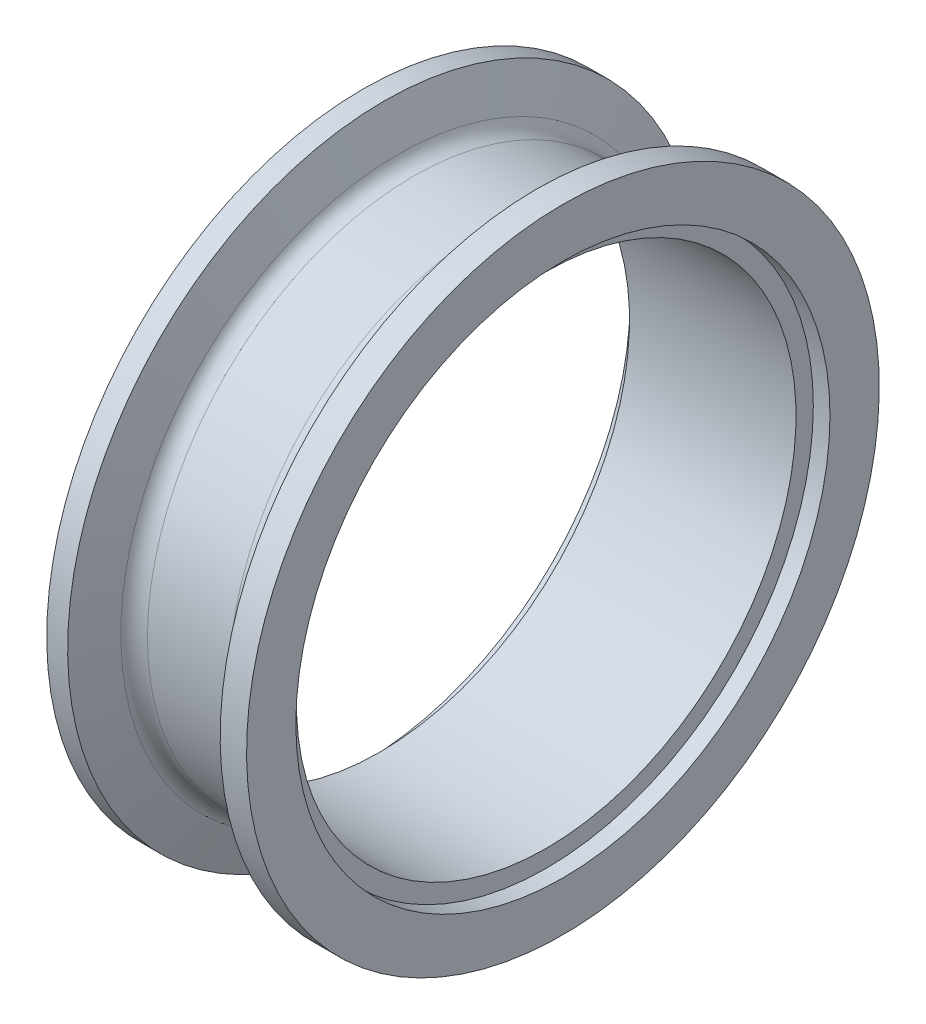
ISO-10303-21;
HEADER;
FILE_DESCRIPTION(('STEP AP214'),'2;1');
FILE_NAME('part.step','',(''),(''),'','','');
FILE_SCHEMA(('AUTOMOTIVE_DESIGN { 1 0 10303 214 1 1 1 1 }'));
ENDSEC;
DATA;
#1=APPLICATION_CONTEXT('core data for automotive mechanical design processes');
#2=APPLICATION_PROTOCOL_DEFINITION('international standard','automotive_design',2000,#1);
#3=PRODUCT_CONTEXT('',#1,'mechanical');
#4=PRODUCT('Part','Part','',(#3));
#5=PRODUCT_RELATED_PRODUCT_CATEGORY('part','',(#4));
#6=PRODUCT_DEFINITION_FORMATION('','',#4);
#7=PRODUCT_DEFINITION_CONTEXT('part definition',#1,'design');
#8=PRODUCT_DEFINITION('design','',#6,#7);
#9=PRODUCT_DEFINITION_SHAPE('','',#8);
#10=(LENGTH_UNIT() NAMED_UNIT(*) SI_UNIT(.MILLI.,.METRE.));
#11=(NAMED_UNIT(*) PLANE_ANGLE_UNIT() SI_UNIT($,.RADIAN.));
#12=(NAMED_UNIT(*) SI_UNIT($,.STERADIAN.) SOLID_ANGLE_UNIT());
#13=UNCERTAINTY_MEASURE_WITH_UNIT(LENGTH_MEASURE(1.E-05),#10,'distance_accuracy_value','');
#14=(GEOMETRIC_REPRESENTATION_CONTEXT(3) GLOBAL_UNCERTAINTY_ASSIGNED_CONTEXT((#13)) GLOBAL_UNIT_ASSIGNED_CONTEXT((#10,
#11,#12)) REPRESENTATION_CONTEXT('',''));
#15=CARTESIAN_POINT('',(0.,0.,0.));
#16=DIRECTION('',(0.,0.,1.));
#17=DIRECTION('',(1.,0.,0.));
#18=AXIS2_PLACEMENT_3D('',#15,#16,#17);
#19=CARTESIAN_POINT('',(0.,60.325,0.));
#20=DIRECTION('',(-1.,0.,0.));
#21=DIRECTION('',(0.,-1.,0.));
#22=AXIS2_PLACEMENT_3D('',#19,#20,#21);
#23=PLANE('',#22);
#24=CARTESIAN_POINT('',(0.,0.,0.));
#25=DIRECTION('',(1.,0.,0.));
#26=DIRECTION('',(0.,1.,0.));
#27=AXIS2_PLACEMENT_3D('',#24,#25,#26);
#28=CIRCLE('',#27,50.927);
#29=CARTESIAN_POINT('',(0.,50.927,0.));
#30=VERTEX_POINT('',#29);
#31=EDGE_CURVE('E95',#30,#30,#28,.T.);
#32=ORIENTED_EDGE('',*,*,#31,.T.);
#33=EDGE_LOOP('',(#32));
#34=FACE_BOUND('',#33,.T.);
#35=CARTESIAN_POINT('',(-1.11022302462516E-13,0.,0.));
#36=DIRECTION('',(1.,0.,0.));
#37=DIRECTION('',(0.,1.,0.));
#38=AXIS2_PLACEMENT_3D('',#35,#36,#37);
#39=CIRCLE('',#38,60.325);
#40=CARTESIAN_POINT('',(0.,60.325,0.));
#41=VERTEX_POINT('',#40);
#42=EDGE_CURVE('E12',#41,#41,#39,.T.);
#43=ORIENTED_EDGE('',*,*,#42,.F.);
#44=EDGE_LOOP('',(#43));
#45=FACE_BOUND('',#44,.T.);
#46=ADVANCED_FACE('F49',(#34,#45),#23,.T.);
#47=CARTESIAN_POINT('',(19.0500000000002,0.,0.));
#48=DIRECTION('',(1.,0.,0.));
#49=DIRECTION('',(0.,1.,0.));
#50=AXIS2_PLACEMENT_3D('',#47,#48,#49);
#51=CYLINDRICAL_SURFACE('',#50,60.325);
#52=ORIENTED_EDGE('',*,*,#42,.T.);
#53=EDGE_LOOP('',(#52));
#54=FACE_BOUND('',#53,.T.);
#55=CARTESIAN_POINT('',(3.98779999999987,0.,0.));
#56=DIRECTION('',(1.,0.,0.));
#57=DIRECTION('',(0.,1.,0.));
#58=AXIS2_PLACEMENT_3D('',#55,#56,#57);
#59=CIRCLE('',#58,60.325);
#60=CARTESIAN_POINT('',(3.98779999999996,60.325,0.));
#61=VERTEX_POINT('',#60);
#62=EDGE_CURVE('E55',#61,#61,#59,.T.);
#63=ORIENTED_EDGE('',*,*,#62,.F.);
#64=EDGE_LOOP('',(#63));
#65=FACE_BOUND('',#64,.T.);
#66=ADVANCED_FACE('F113',(#54,#65),#51,.T.);
#67=CARTESIAN_POINT('',(6.69425134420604,0.,0.));
#68=DIRECTION('',(-1.,0.,0.));
#69=DIRECTION('',(0.,-1.,0.));
#70=AXIS2_PLACEMENT_3D('',#67,#68,#69);
#71=CONICAL_SURFACE('',#70,52.889086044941,1.22173047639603);
#72=ORIENTED_EDGE('',*,*,#62,.T.);
#73=EDGE_LOOP('',(#72));
#74=FACE_BOUND('',#73,.T.);
#75=CARTESIAN_POINT('',(6.69425134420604,0.,0.));
#76=DIRECTION('',(1.,0.,0.));
#77=DIRECTION('',(0.,1.,0.));
#78=AXIS2_PLACEMENT_3D('',#75,#76,#77);
#79=CIRCLE('',#78,52.889086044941);
#80=CARTESIAN_POINT('',(6.69425134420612,52.889086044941,0.));
#81=VERTEX_POINT('',#80);
#82=EDGE_CURVE('E59',#81,#81,#79,.T.);
#83=ORIENTED_EDGE('',*,*,#82,.F.);
#84=EDGE_LOOP('',(#83));
#85=FACE_BOUND('',#84,.T.);
#86=ADVANCED_FACE('F117',(#74,#85),#71,.T.);
#87=CARTESIAN_POINT('',(9.67777541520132,0.,0.));
#88=DIRECTION('',(1.,0.,0.));
#89=DIRECTION('',(0.,1.,0.));
#90=AXIS2_PLACEMENT_3D('',#87,#88,#89);
#91=TOROIDAL_SURFACE('',#90,53.975,3.175);
#92=ORIENTED_EDGE('',*,*,#82,.T.);
#93=EDGE_LOOP('',(#92));
#94=FACE_BOUND('',#93,.T.);
#95=CARTESIAN_POINT('',(9.67777541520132,0.,0.));
#96=DIRECTION('',(1.,0.,0.));
#97=DIRECTION('',(0.,1.,0.));
#98=AXIS2_PLACEMENT_3D('',#95,#96,#97);
#99=CIRCLE('',#98,50.8);
#100=CARTESIAN_POINT('',(9.67777541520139,50.8,0.));
#101=VERTEX_POINT('',#100);
#102=EDGE_CURVE('E63',#101,#101,#99,.T.);
#103=ORIENTED_EDGE('',*,*,#102,.F.);
#104=EDGE_LOOP('',(#103));
#105=FACE_BOUND('',#104,.T.);
#106=ADVANCED_FACE('F121',(#94,#105),#91,.F.);
#107=CARTESIAN_POINT('',(19.0500000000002,0.,0.));
#108=DIRECTION('',(1.,0.,0.));
#109=DIRECTION('',(0.,1.,0.));
#110=AXIS2_PLACEMENT_3D('',#107,#108,#109);
#111=CYLINDRICAL_SURFACE('',#110,50.8);
#112=ORIENTED_EDGE('',*,*,#102,.T.);
#113=EDGE_LOOP('',(#112));
#114=FACE_BOUND('',#113,.T.);
#115=CARTESIAN_POINT('',(25.1576656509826,0.,0.));
#116=DIRECTION('',(1.,0.,0.));
#117=DIRECTION('',(0.,1.,0.));
#118=AXIS2_PLACEMENT_3D('',#115,#116,#117);
#119=CIRCLE('',#118,50.8);
#120=CARTESIAN_POINT('',(25.1576656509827,50.8,0.));
#121=VERTEX_POINT('',#120);
#122=EDGE_CURVE('E68',#121,#121,#119,.T.);
#123=ORIENTED_EDGE('',*,*,#122,.F.);
#124=EDGE_LOOP('',(#123));
#125=FACE_BOUND('',#124,.T.);
#126=ADVANCED_FACE('F127',(#114,#125),#111,.T.);
#127=CARTESIAN_POINT('',(25.1576656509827,0.,0.));
#128=DIRECTION('',(1.,0.,0.));
#129=DIRECTION('',(0.,1.,0.));
#130=AXIS2_PLACEMENT_3D('',#127,#128,#129);
#131=TOROIDAL_SURFACE('',#130,57.15,6.35);
#132=ORIENTED_EDGE('',*,*,#122,.T.);
#133=EDGE_LOOP('',(#132));
#134=FACE_BOUND('',#133,.T.);
#135=CARTESIAN_POINT('',(31.1247137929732,0.,0.));
#136=DIRECTION('',(1.,0.,0.));
#137=DIRECTION('',(0.,1.,0.));
#138=AXIS2_PLACEMENT_3D('',#135,#136,#137);
#139=CIRCLE('',#138,54.978172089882);
#140=CARTESIAN_POINT('',(31.1247137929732,54.978172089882,0.));
#141=VERTEX_POINT('',#140);
#142=EDGE_CURVE('E71',#141,#141,#139,.T.);
#143=ORIENTED_EDGE('',*,*,#142,.F.);
#144=EDGE_LOOP('',(#143));
#145=FACE_BOUND('',#144,.T.);
#146=ADVANCED_FACE('F131',(#134,#145),#131,.F.);
#147=CARTESIAN_POINT('',(33.0707999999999,0.,0.));
#148=DIRECTION('',(1.,0.,0.));
#149=DIRECTION('',(0.,1.,0.));
#150=AXIS2_PLACEMENT_3D('',#147,#148,#149);
#151=CONICAL_SURFACE('',#150,60.3250000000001,1.22173047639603);
#152=ORIENTED_EDGE('',*,*,#142,.T.);
#153=EDGE_LOOP('',(#152));
#154=FACE_BOUND('',#153,.T.);
#155=CARTESIAN_POINT('',(33.0707999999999,0.,0.));
#156=DIRECTION('',(1.,0.,0.));
#157=DIRECTION('',(0.,1.,0.));
#158=AXIS2_PLACEMENT_3D('',#155,#156,#157);
#159=CIRCLE('',#158,60.3250000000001);
#160=CARTESIAN_POINT('',(33.0708,60.3250000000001,0.));
#161=VERTEX_POINT('',#160);
#162=EDGE_CURVE('E74',#161,#161,#159,.T.);
#163=ORIENTED_EDGE('',*,*,#162,.F.);
#164=EDGE_LOOP('',(#163));
#165=FACE_BOUND('',#164,.T.);
#166=ADVANCED_FACE('F135',(#154,#165),#151,.T.);
#167=CARTESIAN_POINT('',(19.0500000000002,0.,0.));
#168=DIRECTION('',(1.,0.,0.));
#169=DIRECTION('',(0.,1.,0.));
#170=AXIS2_PLACEMENT_3D('',#167,#168,#169);
#171=CYLINDRICAL_SURFACE('',#170,60.3250000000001);
#172=ORIENTED_EDGE('',*,*,#162,.T.);
#173=EDGE_LOOP('',(#172));
#174=FACE_BOUND('',#173,.T.);
#175=CARTESIAN_POINT('',(38.0999999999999,0.,0.));
#176=DIRECTION('',(1.,0.,0.));
#177=DIRECTION('',(0.,1.,0.));
#178=AXIS2_PLACEMENT_3D('',#175,#176,#177);
#179=CIRCLE('',#178,60.3250000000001);
#180=CARTESIAN_POINT('',(38.1,60.3250000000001,0.));
#181=VERTEX_POINT('',#180);
#182=EDGE_CURVE('E77',#181,#181,#179,.T.);
#183=ORIENTED_EDGE('',*,*,#182,.F.);
#184=EDGE_LOOP('',(#183));
#185=FACE_BOUND('',#184,.T.);
#186=ADVANCED_FACE('F139',(#174,#185),#171,.T.);
#187=CARTESIAN_POINT('',(38.1,60.3250000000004,0.));
#188=DIRECTION('',(1.,0.,0.));
#189=DIRECTION('',(0.,1.,0.));
#190=AXIS2_PLACEMENT_3D('',#187,#188,#189);
#191=PLANE('',#190);
#192=ORIENTED_EDGE('',*,*,#182,.T.);
#193=EDGE_LOOP('',(#192));
#194=FACE_BOUND('',#193,.T.);
#195=CARTESIAN_POINT('',(38.0999999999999,0.,0.));
#196=DIRECTION('',(1.,0.,0.));
#197=DIRECTION('',(0.,1.,0.));
#198=AXIS2_PLACEMENT_3D('',#195,#196,#197);
#199=CIRCLE('',#198,50.9270000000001);
#200=CARTESIAN_POINT('',(38.1,50.927,0.));
#201=VERTEX_POINT('',#200);
#202=EDGE_CURVE('E80',#201,#201,#199,.T.);
#203=ORIENTED_EDGE('',*,*,#202,.F.);
#204=EDGE_LOOP('',(#203));
#205=FACE_BOUND('',#204,.T.);
#206=ADVANCED_FACE('F143',(#194,#205),#191,.T.);
#207=CARTESIAN_POINT('',(19.0500000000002,0.,0.));
#208=DIRECTION('',(1.,0.,0.));
#209=DIRECTION('',(0.,1.,0.));
#210=AXIS2_PLACEMENT_3D('',#207,#208,#209);
#211=CYLINDRICAL_SURFACE('',#210,50.9270000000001);
#212=ORIENTED_EDGE('',*,*,#202,.T.);
#213=EDGE_LOOP('',(#212));
#214=FACE_BOUND('',#213,.T.);
#215=CARTESIAN_POINT('',(34.9249999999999,0.,0.));
#216=DIRECTION('',(1.,0.,0.));
#217=DIRECTION('',(0.,1.,0.));
#218=AXIS2_PLACEMENT_3D('',#215,#216,#217);
#219=CIRCLE('',#218,50.927);
#220=CARTESIAN_POINT('',(34.925,50.927,0.));
#221=VERTEX_POINT('',#220);
#222=EDGE_CURVE('E83',#221,#221,#219,.T.);
#223=ORIENTED_EDGE('',*,*,#222,.F.);
#224=EDGE_LOOP('',(#223));
#225=FACE_BOUND('',#224,.T.);
#226=ADVANCED_FACE('F147',(#214,#225),#211,.F.);
#227=CARTESIAN_POINT('',(34.925,50.9270000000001,0.));
#228=DIRECTION('',(1.,0.,0.));
#229=DIRECTION('',(0.,1.,0.));
#230=AXIS2_PLACEMENT_3D('',#227,#228,#229);
#231=PLANE('',#230);
#232=ORIENTED_EDGE('',*,*,#222,.T.);
#233=EDGE_LOOP('',(#232));
#234=FACE_BOUND('',#233,.T.);
#235=CARTESIAN_POINT('',(34.9249999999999,0.,0.));
#236=DIRECTION('',(1.,0.,0.));
#237=DIRECTION('',(0.,1.,0.));
#238=AXIS2_PLACEMENT_3D('',#235,#236,#237);
#239=CIRCLE('',#238,47.625);
#240=CARTESIAN_POINT('',(34.925,47.625,0.));
#241=VERTEX_POINT('',#240);
#242=EDGE_CURVE('E86',#241,#241,#239,.T.);
#243=ORIENTED_EDGE('',*,*,#242,.F.);
#244=EDGE_LOOP('',(#243));
#245=FACE_BOUND('',#244,.T.);
#246=ADVANCED_FACE('F151',(#234,#245),#231,.T.);
#247=CARTESIAN_POINT('',(19.0500000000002,0.,0.));
#248=DIRECTION('',(1.,0.,0.));
#249=DIRECTION('',(0.,1.,0.));
#250=AXIS2_PLACEMENT_3D('',#247,#248,#249);
#251=CYLINDRICAL_SURFACE('',#250,47.625);
#252=ORIENTED_EDGE('',*,*,#242,.T.);
#253=EDGE_LOOP('',(#252));
#254=FACE_BOUND('',#253,.T.);
#255=CARTESIAN_POINT('',(3.17499999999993,0.,0.));
#256=DIRECTION('',(1.,0.,0.));
#257=DIRECTION('',(0.,1.,0.));
#258=AXIS2_PLACEMENT_3D('',#255,#256,#257);
#259=CIRCLE('',#258,47.6249999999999);
#260=CARTESIAN_POINT('',(3.175,47.625,0.));
#261=VERTEX_POINT('',#260);
#262=EDGE_CURVE('E89',#261,#261,#259,.T.);
#263=ORIENTED_EDGE('',*,*,#262,.F.);
#264=EDGE_LOOP('',(#263));
#265=FACE_BOUND('',#264,.T.);
#266=ADVANCED_FACE('F109',(#254,#265),#251,.F.);
#267=CARTESIAN_POINT('',(3.17499999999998,50.927,0.));
#268=DIRECTION('',(-1.,0.,0.));
#269=DIRECTION('',(0.,-1.,0.));
#270=AXIS2_PLACEMENT_3D('',#267,#268,#269);
#271=PLANE('',#270);
#272=ORIENTED_EDGE('',*,*,#262,.T.);
#273=EDGE_LOOP('',(#272));
#274=FACE_BOUND('',#273,.T.);
#275=CARTESIAN_POINT('',(3.17499999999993,0.,0.));
#276=DIRECTION('',(1.,0.,0.));
#277=DIRECTION('',(0.,1.,0.));
#278=AXIS2_PLACEMENT_3D('',#275,#276,#277);
#279=CIRCLE('',#278,50.927);
#280=CARTESIAN_POINT('',(3.175,50.927,0.));
#281=VERTEX_POINT('',#280);
#282=EDGE_CURVE('E92',#281,#281,#279,.T.);
#283=ORIENTED_EDGE('',*,*,#282,.F.);
#284=EDGE_LOOP('',(#283));
#285=FACE_BOUND('',#284,.T.);
#286=ADVANCED_FACE('F103',(#274,#285),#271,.T.);
#287=CARTESIAN_POINT('',(19.0500000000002,0.,0.));
#288=DIRECTION('',(1.,0.,0.));
#289=DIRECTION('',(0.,1.,0.));
#290=AXIS2_PLACEMENT_3D('',#287,#288,#289);
#291=CYLINDRICAL_SURFACE('',#290,50.927);
#292=ORIENTED_EDGE('',*,*,#282,.T.);
#293=EDGE_LOOP('',(#292));
#294=FACE_BOUND('',#293,.T.);
#295=ORIENTED_EDGE('',*,*,#31,.F.);
#296=EDGE_LOOP('',(#295));
#297=FACE_BOUND('',#296,.T.);
#298=ADVANCED_FACE('F101',(#294,#297),#291,.F.);
#299=CLOSED_SHELL('',(#46,#66,#86,#106,#126,#146,#166,#186,#206,#226,#246,#266,#286,#298));
#300=MANIFOLD_SOLID_BREP('B2',#299);
#301=ADVANCED_BREP_SHAPE_REPRESENTATION('',(#18,#300),#14);
#302=SHAPE_DEFINITION_REPRESENTATION(#9,#301);
ENDSEC;
END-ISO-10303-21;
